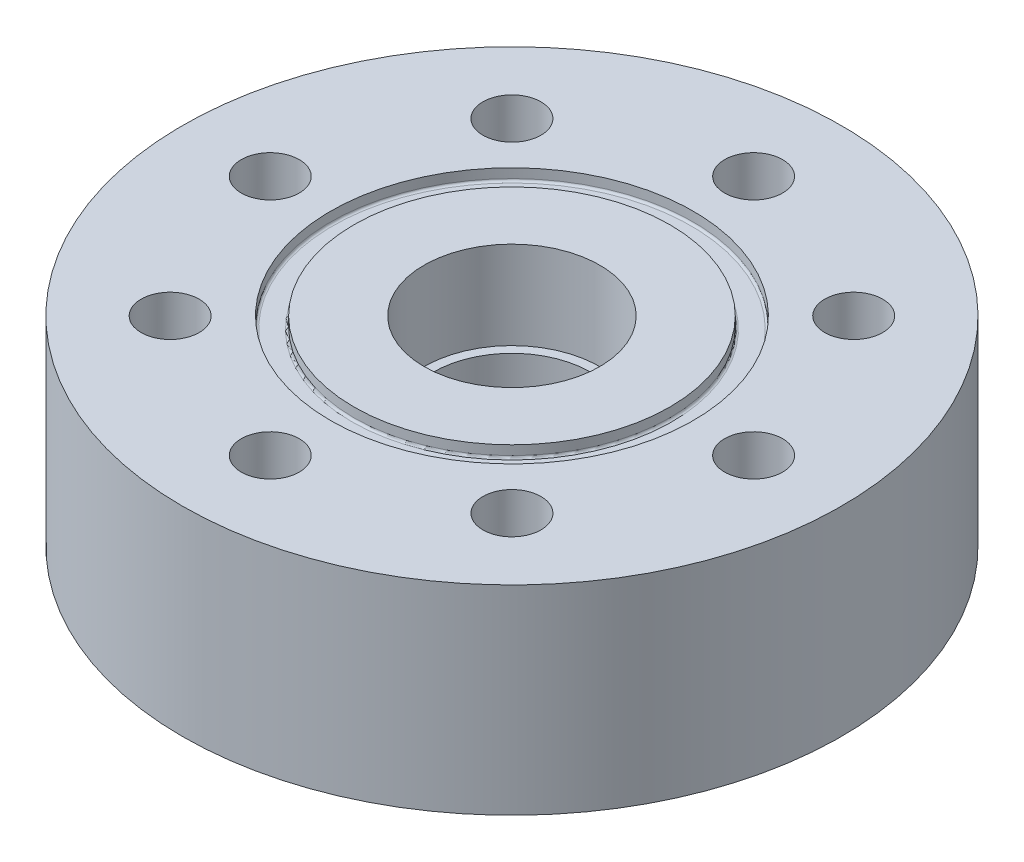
from build123d import *

# Parameters (mm, degrees)
SKETCH2_R                 = 37.5
OUTER_CYLINDER_DEPTH      = 22.7
SKETCH3_R                 = 8.93
NPT_HOLE_DEPTH            = 12.7
SKETCH4_R                 = 3.3
BOLT_HOLES_DEPTH          = 58.687000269
SKETCH5_R                 = 20.6375
SKETCH5_R_2               = 17.9705
O_RING_GROOVE_DEPTH       = 1.3208
FILLET1_R                 = 0.254
SKETCH6_R                 = 10
INLET_FLOW_DIAMETER_DEPTH = 10


with BuildPart() as part:
    # Sketch2 → Outer Cylinder (new body)
    with BuildSketch(Plane(origin=(0, 0, 0), x_dir=(1, 0, 0), z_dir=(0, 1, 0))):
        with Locations(Location((0, 0, 0), (0, 0, 270))):
            Circle(SKETCH2_R)
    extrude(amount=OUTER_CYLINDER_DEPTH)

    # Sketch3 → NPT Hole (cut)
    with BuildSketch(Plane.XZ):
        with Locations(Location((0, 0, 0), (0, 0, 270))):
            Circle(SKETCH3_R)
    extrude(amount=-NPT_HOLE_DEPTH, mode=Mode.SUBTRACT)

    # Sketch4 → Bolt Holes (cut, through all)
    with BuildSketch(Plane.XZ):
        with Locations(Location((-27.5, 0, 0), (0, 0, 270))):
            Circle(SKETCH4_R)
        with Locations(Location((-19.445436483, 19.445436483, 0), (0, 0, 270))):
            Circle(SKETCH4_R)
        with Locations(Location((0, 27.5, 0), (0, 0, 270))):
            Circle(SKETCH4_R)
        with Locations(Location((19.445436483, 19.445436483, 0), (0, 0, 270))):
            Circle(SKETCH4_R)
        with Locations(Location((27.5, 0, 0), (0, 0, 270))):
            Circle(SKETCH4_R)
        with Locations(Location((19.445436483, -19.445436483, 0), (0, 0, 270))):
            Circle(SKETCH4_R)
        with Locations(Location((0, -27.5, 0), (0, 0, 270))):
            Circle(SKETCH4_R)
        with Locations(Location((-19.445436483, -19.445436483, 0), (0, 0, 270))):
            Circle(SKETCH4_R)
    extrude(amount=-BOLT_HOLES_DEPTH, mode=Mode.SUBTRACT)

    # Sketch5 → O-Ring Groove (cut)
    with BuildSketch(Plane(origin=(0, 22.7, 0), x_dir=(1, 0, 0), z_dir=(0, 1, 0))):
        with Locations(Location((0, 0, 0), (0, 0, 270))):
            Circle(SKETCH5_R)
        with Locations(Location((0, 0, 0), (0, 0, 270))):
            Circle(SKETCH5_R_2, mode=Mode.SUBTRACT)
    extrude(amount=-O_RING_GROOVE_DEPTH, mode=Mode.SUBTRACT)

    # Fillet1
    fillet1_edges = [part.edges().sort_by_distance(p)[0] for p in [
        (0, 21.3792, -20.6375),
        (0, 21.3792, -17.9705),
    ]]
    fillet(fillet1_edges, radius=FILLET1_R)

    # Sketch6 → Inlet Flow Diameter (cut)
    with BuildSketch(Plane(origin=(0, 22.7, 0), x_dir=(1, 0, 0), z_dir=(0, 1, 0))):
        with Locations(Location((0, 0, 0), (0, 0, 270))):
            Circle(SKETCH6_R)
    extrude(amount=-INLET_FLOW_DIAMETER_DEPTH, mode=Mode.SUBTRACT)


solid = part.part
